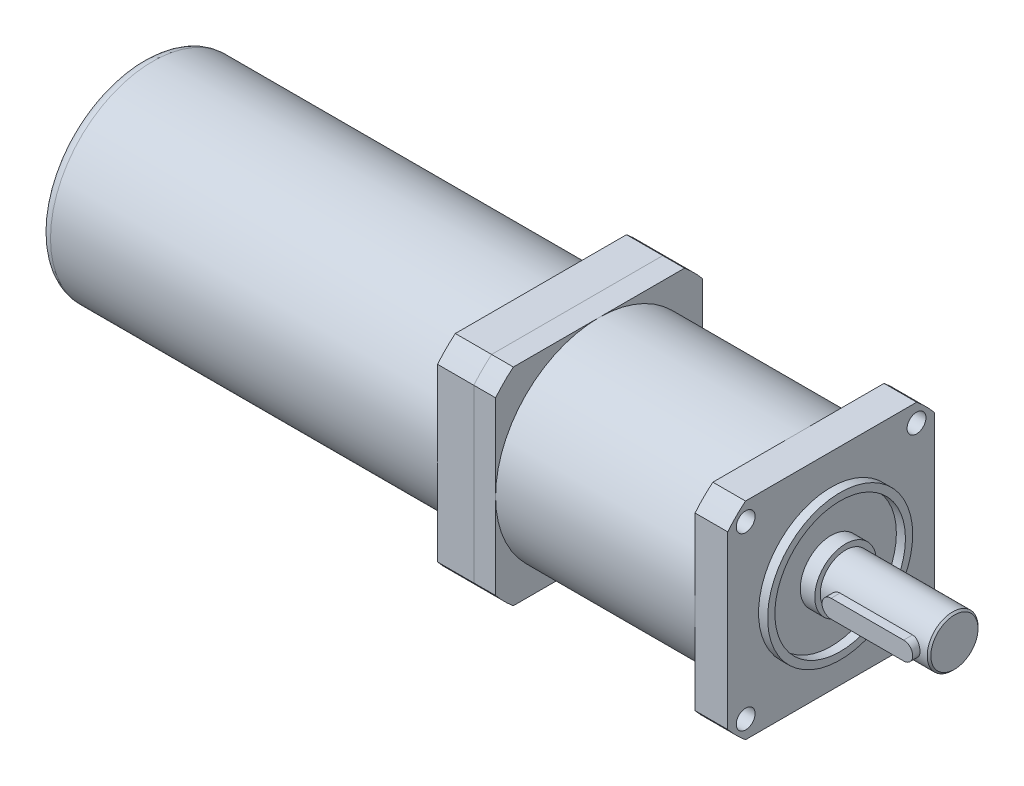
from build123d import *

# Parameters (mm, degrees)
EXTRUDE_1_DEPTH     = 9
SKETCH_2_R          = 28.5
EXTRUDE_2_DEPTH     = 55
EXTRUDE_3_DEPTH     = 6
SKETCH_6_R          = 2.6
CUT_EXTRUDE_2_DEPTH = 9
SKETCH_7_R          = 20
SKETCH_7_R_2        = 18
EXTRUDE_5_DEPTH     = 2.5
SKETCH_8_R          = 8.5
EXTRUDE_6_DEPTH     = 4
SKETCH_9_R          = 7
EXTRUDE_7_DEPTH     = 30
CUT_EXTRUDE_3_DEPTH = 3
EXTRUDE_START       = 5
EXTRUDE_8_DEPTH     = 5
CHAMFER_1_SIZE      = 0.5
EXTRUDE_9_DEPTH     = 10
SKETCH_15_R         = 28.2
EXTRUDE_10_DEPTH    = 110
FILLET_1_R          = 3


with BuildPart() as part:
    # Sketch 1 → Extrude 1 (new body)
    with BuildSketch(Plane(origin=(0, 0, 0), x_dir=(0, 0, -1), z_dir=(1, 0, 0))):
        with BuildLine():
            Line((-23.595550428, -28.5), (23.595550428, -28.5))
            ThreePointArc((23.595550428, -28.5), (26.162950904, -26.162950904), (28.5, -23.595550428))
            Line((28.5, -23.595550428), (28.5, 23.595550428))
            ThreePointArc((28.5, 23.595550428), (26.162950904, 26.162950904), (23.595550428, 28.5))
            Line((23.595550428, 28.5), (-23.595550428, 28.5))
            ThreePointArc((-23.595550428, 28.5), (-26.162950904, 26.162950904), (-28.5, 23.595550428))
            Line((-28.5, 23.595550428), (-28.5, -23.595550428))
            ThreePointArc((-28.5, -23.595550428), (-26.162950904, -26.162950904), (-23.595550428, -28.5))
        make_face()
    extrude(amount=-EXTRUDE_1_DEPTH)

    # Sketch 2 → Extrude 2 (add)
    with BuildSketch(Plane.ZY.offset(9)):
        Circle(SKETCH_2_R)
    extrude(amount=EXTRUDE_2_DEPTH)

    # Sketch 3 → Extrude 3 (add)
    with BuildSketch(Plane.ZY.offset(64)):
        with BuildLine():
            Line((-23.595550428, -28.5), (23.595550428, -28.5))
            ThreePointArc((23.595550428, -28.5), (26.162950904, -26.162950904), (28.5, -23.595550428))
            Line((28.5, -23.595550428), (28.5, 23.595550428))
            ThreePointArc((28.5, 23.595550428), (26.162950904, 26.162950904), (23.595550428, 28.5))
            Line((23.595550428, 28.5), (-23.595550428, 28.5))
            ThreePointArc((-23.595550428, 28.5), (-26.162950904, 26.162950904), (-28.5, 23.595550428))
            Line((-28.5, 23.595550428), (-28.5, -23.595550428))
            ThreePointArc((-28.5, -23.595550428), (-26.162950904, -26.162950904), (-23.595550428, -28.5))
        make_face()
    extrude(amount=EXTRUDE_3_DEPTH)

    # Sketch 6 → Cut-Extrude 2 (cut)
    with BuildSketch(Plane(origin=(0, 0, 0), x_dir=(0, 0, -1), z_dir=(1, 0, 0))):
        with Locations((-23.55, 23.55)):
            Circle(SKETCH_6_R)
        with Locations((23.55, 23.55)):
            Circle(SKETCH_6_R)
        with Locations((23.55, -23.55)):
            Circle(SKETCH_6_R)
        with Locations((-23.55, -23.55)):
            Circle(SKETCH_6_R)
    extrude(amount=-CUT_EXTRUDE_2_DEPTH, mode=Mode.SUBTRACT)

    # Sketch 7 → Extrude 5 (add)
    with BuildSketch(Plane(origin=(0, 0, 0), x_dir=(0, 0, -1), z_dir=(1, 0, 0))):
        Circle(SKETCH_7_R)
        Circle(SKETCH_7_R_2, mode=Mode.SUBTRACT)
    extrude(amount=EXTRUDE_5_DEPTH)

    # Sketch 8 → Extrude 6 (add)
    with BuildSketch(Plane(origin=(0, 0, 0), x_dir=(0, 0, -1), z_dir=(1, 0, 0))):
        Circle(SKETCH_8_R)
    extrude(amount=EXTRUDE_6_DEPTH)

    # Sketch 9 → Extrude 7 (add)
    with BuildSketch(Plane(origin=(4, 0, 0), x_dir=(0, 0, -1), z_dir=(1, 0, 0))):
        Circle(SKETCH_9_R)
    extrude(amount=EXTRUDE_7_DEPTH)

    # Sketch 10 → Cut-Extrude 3 (cut)
    with BuildSketch(Plane.XY.offset(7)):
        with BuildLine():
            Line((9, 2.5), (29, 2.5))
            ThreePointArc((29, 2.5), (31.5, 0), (29, -2.5))
            Line((29, -2.5), (9, -2.5))
            ThreePointArc((9, -2.5), (6.5, 0), (9, 2.5))
        make_face()
    extrude(amount=-CUT_EXTRUDE_3_DEPTH, mode=Mode.SUBTRACT)

    # Sketch 11 → Extrude 8 (add)
    with BuildSketch(Plane.XY.offset(4).offset(EXTRUDE_START)):
        with BuildLine():
            Line((9, 2.5), (29, 2.5))
            ThreePointArc((29, 2.5), (31.5, 0), (29, -2.5))
            Line((29, -2.5), (9, -2.5))
            ThreePointArc((9, -2.5), (6.5, 0), (9, 2.5))
        make_face()
    extrude(amount=-EXTRUDE_8_DEPTH)

    # Chamfer 1
    chamfer_1_edges = [part.edges().sort_by_distance(p)[0] for p in [
        (34, 0, 7),
    ]]
    chamfer(chamfer_1_edges, length=CHAMFER_1_SIZE)


with BuildPart() as body_2:
    # Sketch 14 → Extrude 9 (new body)
    with BuildSketch(Plane.ZY.offset(70)):
        with BuildLine():
            Line((-23.595550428, -28.5), (23.595550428, -28.5))
            ThreePointArc((23.595550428, -28.5), (26.162950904, -26.162950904), (28.5, -23.595550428))
            Line((28.5, -23.595550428), (28.5, 23.595550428))
            ThreePointArc((28.5, 23.595550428), (26.162950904, 26.162950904), (23.595550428, 28.5))
            Line((23.595550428, 28.5), (-23.595550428, 28.5))
            ThreePointArc((-23.595550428, 28.5), (-26.162950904, 26.162950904), (-28.5, 23.595550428))
            Line((-28.5, 23.595550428), (-28.5, -23.595550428))
            ThreePointArc((-28.5, -23.595550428), (-26.162950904, -26.162950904), (-23.595550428, -28.5))
        make_face()
    extrude(amount=EXTRUDE_9_DEPTH)

    # Sketch 15 → Extrude 10 (add)
    with BuildSketch(Plane.ZY.offset(80)):
        Circle(SKETCH_15_R)
    extrude(amount=EXTRUDE_10_DEPTH)

    # Fillet 1
    fillet_1_edges = [body_2.edges().sort_by_distance(p)[0] for p in [
        (-190, 0, -28.2),
    ]]
    fillet(fillet_1_edges, radius=FILLET_1_R)


solid = Compound([part.part, body_2.part])
